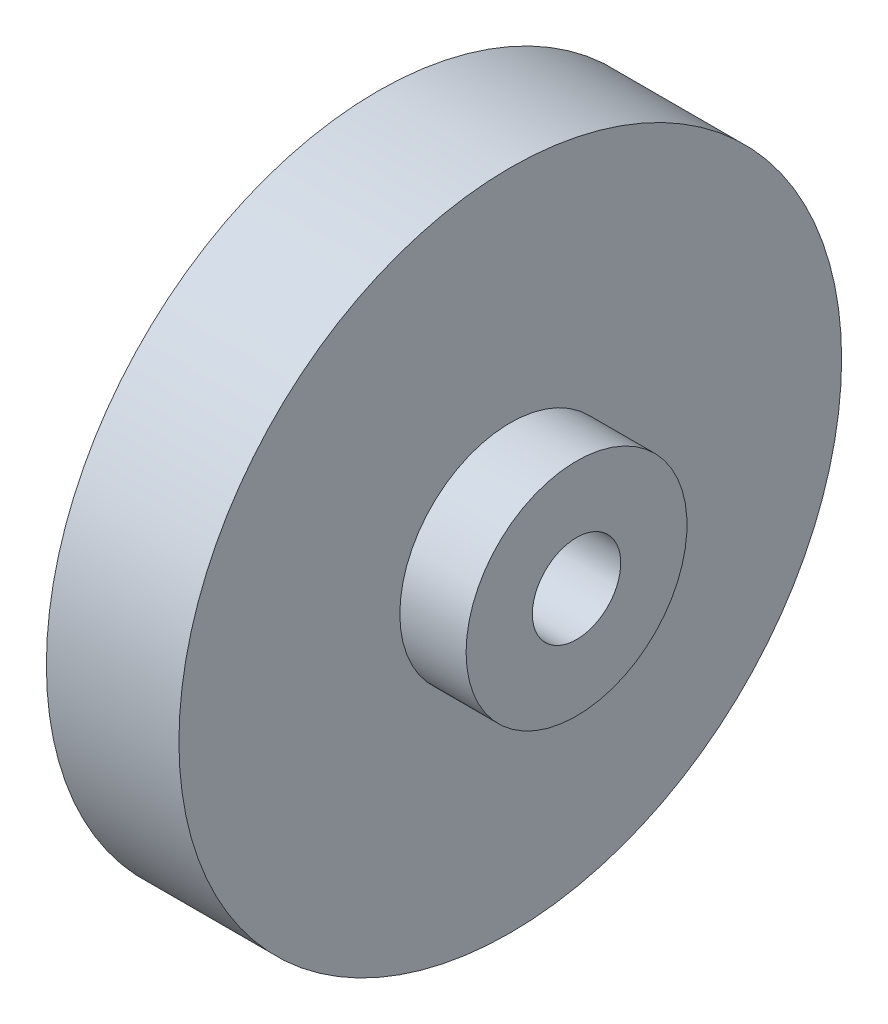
from build123d import *


with BuildPart() as part:
    # Sketch1 → Revolve1 (revolve)
    with BuildSketch(Plane.XY, mode=Mode.PRIVATE) as revolve1_sk:
        Polygon((0, 5), (0, 2), (12, 2), (12, 5), (9, 5), (9, 15), (3, 15), (3, 5), align=None)
    revolve(revolve1_sk.sketch.rotate(Axis((0, 0, 0), (1, 0, 0)), 90), axis=Axis((0, 0, 0), (1, 0, 0)))


solid = part.part
